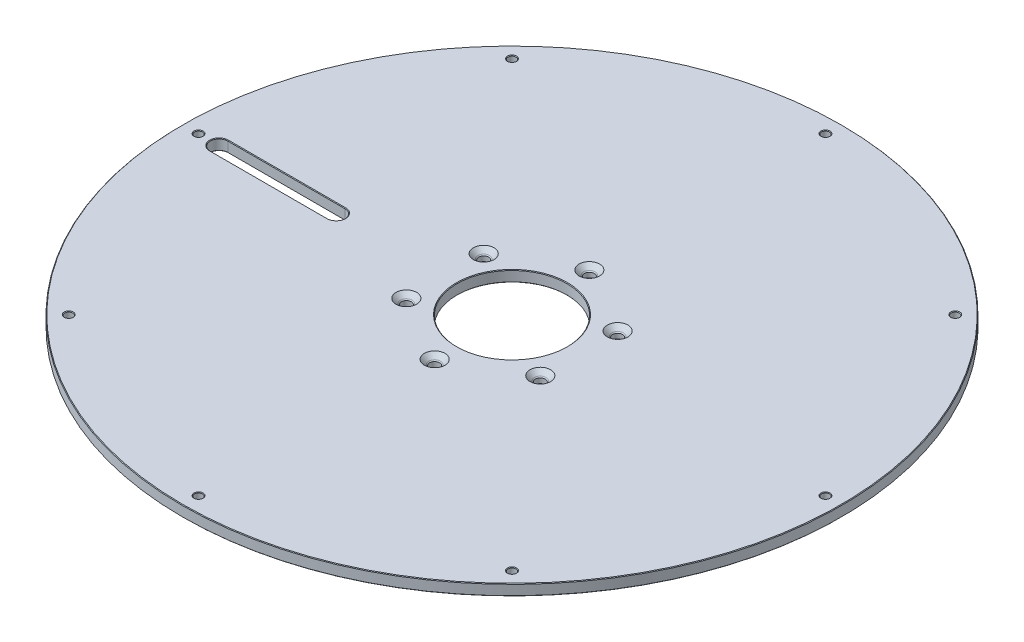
from build123d import *
from OCP.BRepFilletAPI import BRepFilletAPI_MakeChamfer

# Parameters (mm, degrees)
SKETCH1_W                 = 119.0625
SKETCH1_H                 = 4.7625
CUT_EXTRUDE1_DEPTH        = 203.111881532
F_8_32_TAPPED_HOLE1_D     = 3.4544
F_8_32_TAPPED_HOLE1_DEPTH = 12.446
CIRPATTERN1_COUNT         = 8
CIRPATTERN2_COUNT         = 6
CHAMFER1_SIZE             = 0.254
CHAMFER1_SIZE2            = 2.574744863


with BuildPart() as part:
    # Sketch1 → Revolve1 (revolve)
    with BuildSketch(Plane.XY, mode=Mode.PRIVATE) as revolve1_sk:
        with Locations((-83.34375, -2.38125)):
            Rectangle(SKETCH1_W, SKETCH1_H)
    revolve(revolve1_sk.sketch.rotate(Axis((0, 0, 0), (0, 1, 0)), 270), axis=Axis((0, 0, 0), (0, 1, 0)))

    # Sketch5 → Cut-Extrude1 (cut, through all)
    with BuildSketch(Plane(origin=(0, 0, 0), x_dir=(1, 0, 0), z_dir=(0, 1, 0))):
        with BuildLine():
            Line((-76.2, -3.81), (-127, -3.81))
            ThreePointArc((-127, -3.81), (-130.81, 0), (-127, 3.81))
            Line((-127, 3.81), (-76.2, 3.81))
            ThreePointArc((-76.2, 3.81), (-72.39, 0), (-76.2, -3.81))
        make_face()
    extrude(amount=-CUT_EXTRUDE1_DEPTH, mode=Mode.SUBTRACT)

    # 8-32 Tapped Hole1
    with Locations(Plane(origin=(0, 0, 0), x_dir=(1, 0, 0), z_dir=(0, 1, 0))):
        with Locations((0, -135.89)):
            f_8_32_tapped_hole1 = Hole(F_8_32_TAPPED_HOLE1_D / 2, depth=F_8_32_TAPPED_HOLE1_DEPTH)

    # CirPattern1: 8-32 Tapped Hole1 ×8 about axis
    cirpattern1_axis = Axis((0, 0, 0), (0, 1, 0))
    for i in range(1, CIRPATTERN1_COUNT):
        add(f_8_32_tapped_hole1.rotate(cirpattern1_axis, i * 360 / CIRPATTERN1_COUNT), mode=Mode.SUBTRACT)

    # Sketch9 → CSK for _8 Flat Head Machine Screw1 (revolve, cut)
    with BuildSketch(Plane(origin=(-29.036099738, 0, -16.764), x_dir=(0, 0, 1), z_dir=(1, 0, 0))):
        Polygon((0, 0), (0, 4.7625), (2.15265, 4.7625), (2.15265, 2.3740728), (4.2164, 0), align=None)
    csk_for_8_flat_head_machine_screw1 = revolve(axis=Axis((-29.036099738, 6.35, -16.764), (0, -1, 0)), mode=Mode.SUBTRACT)

    # CirPattern2: CSK for _8 Flat Head Machine Screw1 ×6 about axis
    cirpattern2_axis = Axis((0, 0, 0), (0, 1, 0))
    for i in range(1, CIRPATTERN2_COUNT):
        add(csk_for_8_flat_head_machine_screw1.rotate(cirpattern2_axis, i * 360 / CIRPATTERN2_COUNT), mode=Mode.SUBTRACT)

    # Chamfer1: one chamfer whose edges measure the first distance from different faces: ONE call of the kernel's chamfer builder (chamfer() names one face for all edges)
    chamfer1_edges_1 = [part.edges().sort_by_distance(p)[0] for p in [
        (-130.81, -4.7625, 0),
        (-101.6, -4.7625, -3.81),
        (-72.39, -4.7625, 0),
        (-101.6, -4.7625, 3.81),
        (-130.81, 0, 0),
        (-101.6, 0, 3.81),
        (-72.39, 0, 0),
        (-101.6, 0, -3.81),
        (1.7272, -4.7625, 135.89),
        (1.7272, 0, 135.89),
        (-94.867425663, -4.7625, 97.310055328),
        (-94.867425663, 0, 97.310055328),
        (0, 0, 23.8125),
        (-135.89, -4.7625, 1.7272),
        (-135.89, 0, 1.7272),
        (0, 0, 142.875),
        (-97.310055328, -4.7625, -94.867425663),
        (-97.310055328, 0, -94.867425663),
        (0, -4.7625, 142.875),
        (-1.7272, -4.7625, -135.89),
        (-1.7272, 0, -135.89),
        (0, -4.7625, 23.8125),
        (94.867425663, -4.7625, -97.310055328),
        (94.867425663, 0, -97.310055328),
        (135.89, -4.7625, -1.7272),
        (135.89, 0, -1.7272),
        (97.310055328, -4.7625, 94.867425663),
        (97.310055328, 0, 94.867425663),
        (-29.036099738, -4.7625, -18.91665),
        (1.864249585, -4.7625, -34.604325),
        (30.900349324, -4.7625, -15.687675),
        (29.036099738, -4.7625, 18.91665),
        (-1.864249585, -4.7625, 34.604325),
        (-30.900349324, -4.7625, 15.687675),
    ]]
    chamfer1_edges_2 = [part.edges().sort_by_distance(p)[0] for p in [
        (-29.036099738, 0, -20.9804),
        (3.651509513, 0, -35.6362),
        (32.687609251, 0, -14.6558),
        (29.036099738, 0, 20.9804),
        (-3.651509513, 0, 35.6362),
        (-32.687609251, 0, 14.6558),
    ]]
    chamfer1_side_2 = [part.faces().sort_by_distance(p)[0] for p in [
        (0, 0, 138.833884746),
    ]]
    chamfer1 = BRepFilletAPI_MakeChamfer(part.part.solid().wrapped)
    for e in chamfer1_edges_1:
        chamfer1.Add(CHAMFER1_SIZE, e.wrapped)
    for e in chamfer1_edges_2:
        chamfer1.Add(CHAMFER1_SIZE, CHAMFER1_SIZE2, e.wrapped, chamfer1_side_2[0].wrapped)  # the first distance lies on this face
    add(Compound.cast(chamfer1.Shape()), mode=Mode.REPLACE)


solid = part.part
